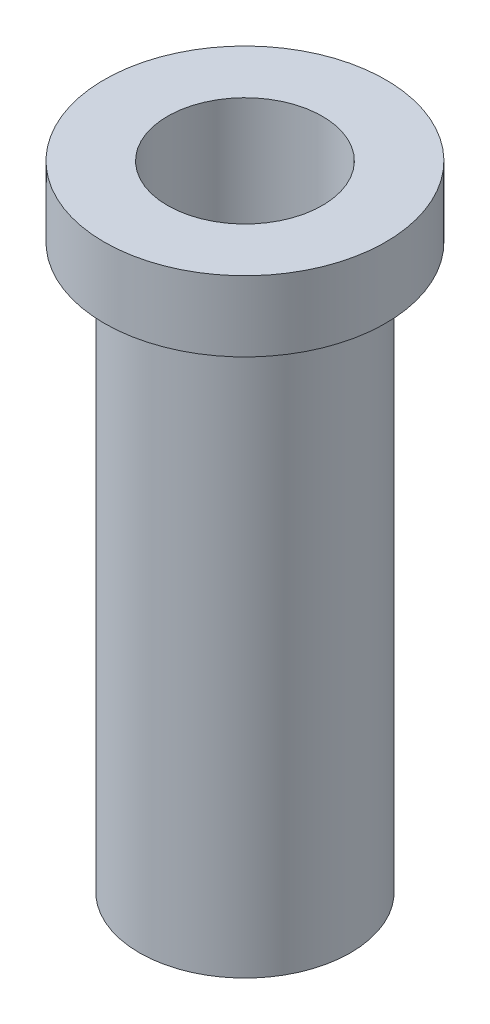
from build123d import *

# Parameters (mm, degrees)
SKETCH1_R           = 10
SKETCH1_R_2         = 5.5
BOSS_EXTRUDE1_DEPTH = 5
SKETCH2_R           = 7.5
BOSS_EXTRUDE2_DEPTH = 40
SKETCH3_R           = 5.5
CUT_EXTRUDE1_DEPTH  = 43.426406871


with BuildPart() as part:
    # Sketch1 → Boss-Extrude1 (new body)
    with BuildSketch(Plane(origin=(0, 0, 0), x_dir=(1, 0, 0), z_dir=(0, 1, 0))):
        with Locations(Location((0, 0, 0), (0, 0, 270))):
            Circle(SKETCH1_R)
        with Locations(Location((0, 0, 0), (0, 0, 270))):
            Circle(SKETCH1_R_2, mode=Mode.SUBTRACT)
    extrude(amount=BOSS_EXTRUDE1_DEPTH)

    # Sketch2 → Boss-Extrude2 (add)
    with BuildSketch(Plane.XZ):
        with Locations(Location((0, 0, 0), (0, 0, 90))):
            Circle(SKETCH2_R)
    extrude(amount=BOSS_EXTRUDE2_DEPTH)

    # Sketch3 → Cut-Extrude1 (cut, through all)
    with BuildSketch(Plane(origin=(0, 0, 0), x_dir=(1, 0, 0), z_dir=(0, 1, 0))):
        with Locations(Location((0, 0, 0), (0, 0, 270))):
            Circle(SKETCH3_R)
    extrude(amount=-CUT_EXTRUDE1_DEPTH, mode=Mode.SUBTRACT)


solid = part.part
